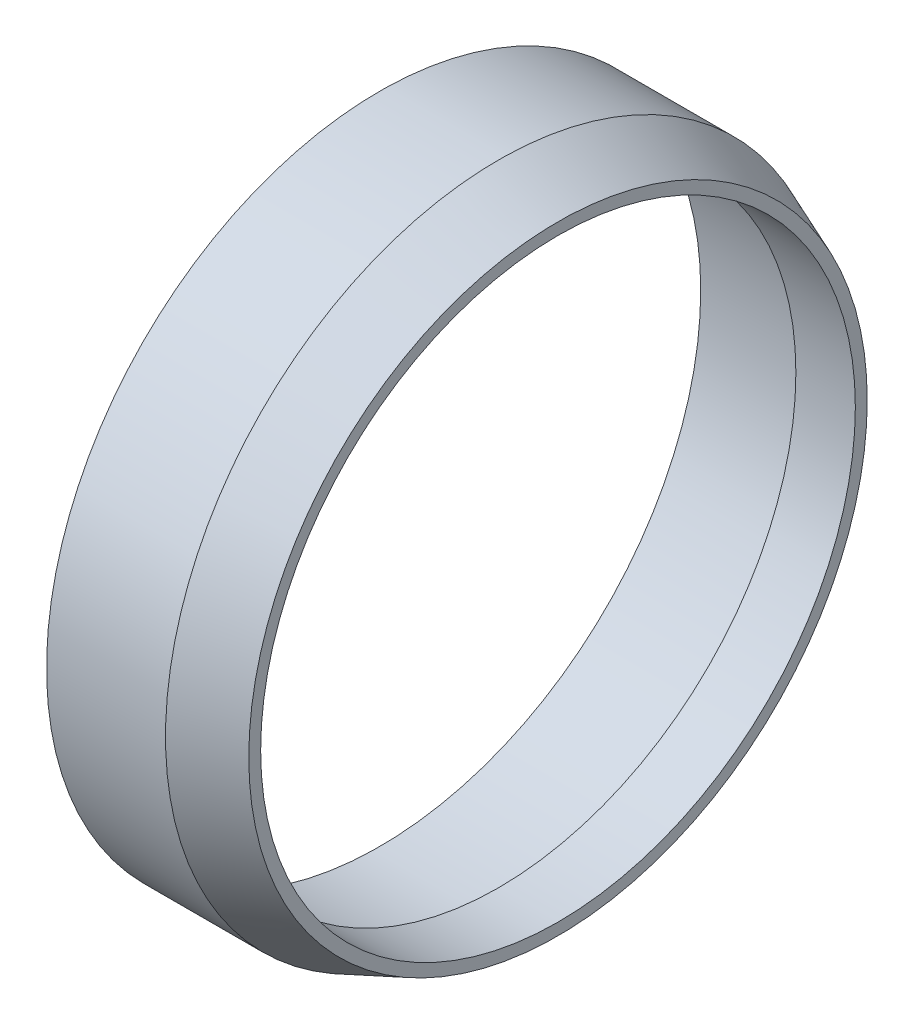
from build123d import *


with BuildPart() as part:
    # Esquisse2 → Base-R_volution (revolve)
    with BuildSketch(Plane(origin=(0, 0, 0), x_dir=(1, 0, 0), z_dir=(0, 1, 0)), mode=Mode.PRIVATE) as base_r_volution_sk:
        Polygon((0, -25), (0, -27), (-10, -27), (-10, -28), (0, -28), (5, -26), (5, -25), align=None)
    revolve(base_r_volution_sk.sketch.rotate(Axis((37.900503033, 0, 0), (-1, 0, 0)), 180), axis=Axis((37.900503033, 0, 0), (-1, 0, 0)))


solid = part.part
